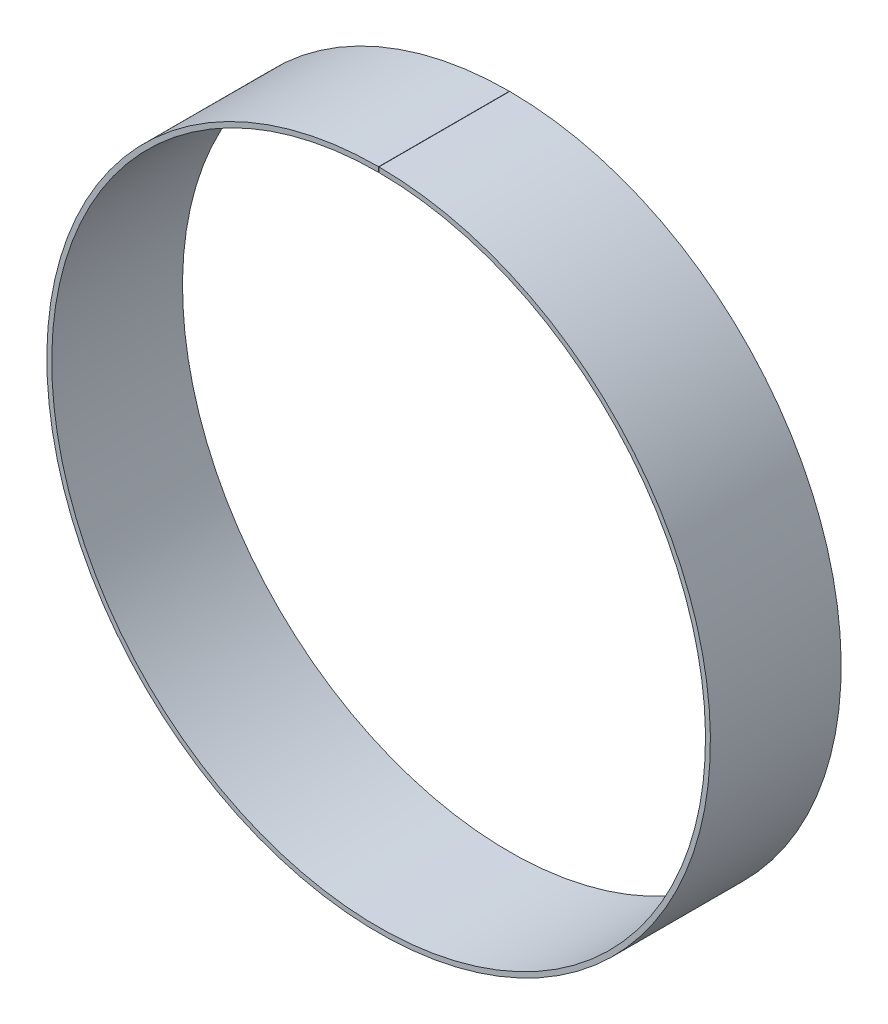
ISO-10303-21;
HEADER;
FILE_DESCRIPTION(('STEP AP214'),'2;1');
FILE_NAME('part.step','',(''),(''),'','','');
FILE_SCHEMA(('AUTOMOTIVE_DESIGN { 1 0 10303 214 1 1 1 1 }'));
ENDSEC;
DATA;
#1=APPLICATION_CONTEXT('core data for automotive mechanical design processes');
#2=APPLICATION_PROTOCOL_DEFINITION('international standard','automotive_design',2000,#1);
#3=PRODUCT_CONTEXT('',#1,'mechanical');
#4=PRODUCT('Part','Part','',(#3));
#5=PRODUCT_RELATED_PRODUCT_CATEGORY('part','',(#4));
#6=PRODUCT_DEFINITION_FORMATION('','',#4);
#7=PRODUCT_DEFINITION_CONTEXT('part definition',#1,'design');
#8=PRODUCT_DEFINITION('design','',#6,#7);
#9=PRODUCT_DEFINITION_SHAPE('','',#8);
#10=(LENGTH_UNIT() NAMED_UNIT(*) SI_UNIT(.MILLI.,.METRE.));
#11=(NAMED_UNIT(*) PLANE_ANGLE_UNIT() SI_UNIT($,.RADIAN.));
#12=(NAMED_UNIT(*) SI_UNIT($,.STERADIAN.) SOLID_ANGLE_UNIT());
#13=UNCERTAINTY_MEASURE_WITH_UNIT(LENGTH_MEASURE(1.E-05),#10,'distance_accuracy_value','');
#14=(GEOMETRIC_REPRESENTATION_CONTEXT(3) GLOBAL_UNCERTAINTY_ASSIGNED_CONTEXT((#13)) GLOBAL_UNIT_ASSIGNED_CONTEXT((#10,
#11,#12)) REPRESENTATION_CONTEXT('',''));
#15=CARTESIAN_POINT('',(0.,0.,0.));
#16=DIRECTION('',(0.,0.,1.));
#17=DIRECTION('',(1.,0.,0.));
#18=AXIS2_PLACEMENT_3D('',#15,#16,#17);
#19=CARTESIAN_POINT('',(0.,0.,20.));
#20=DIRECTION('',(0.,0.,-1.));
#21=DIRECTION('',(-1.,0.,0.));
#22=AXIS2_PLACEMENT_3D('',#19,#20,#21);
#23=CYLINDRICAL_SURFACE('',#22,101.5);
#24=CARTESIAN_POINT('',(0.,0.,-20.));
#25=DIRECTION('',(0.,0.,1.));
#26=DIRECTION('',(1.,0.,0.));
#27=AXIS2_PLACEMENT_3D('',#24,#25,#26);
#28=CIRCLE('',#27,101.5);
#29=CARTESIAN_POINT('',(0.,101.5,-20.));
#30=VERTEX_POINT('',#29);
#31=CARTESIAN_POINT('',(0.101499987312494,101.49994925,-20.));
#32=VERTEX_POINT('',#31);
#33=EDGE_CURVE('E97',#30,#32,#28,.T.);
#34=ORIENTED_EDGE('',*,*,#33,.T.);
#35=DIRECTION('',(0.,0.,-1.));
#36=VECTOR('',#35,1.);
#37=CARTESIAN_POINT('',(0.101499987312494,101.49994925,20.));
#38=LINE('',#37,#36);
#39=CARTESIAN_POINT('',(0.101499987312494,101.49994925,20.));
#40=VERTEX_POINT('',#39);
#41=EDGE_CURVE('E11',#40,#32,#38,.T.);
#42=ORIENTED_EDGE('',*,*,#41,.F.);
#43=CARTESIAN_POINT('',(0.,0.,20.));
#44=DIRECTION('',(0.,0.,1.));
#45=DIRECTION('',(1.,0.,0.));
#46=AXIS2_PLACEMENT_3D('',#43,#44,#45);
#47=CIRCLE('',#46,101.5);
#48=CARTESIAN_POINT('',(0.,101.5,20.));
#49=VERTEX_POINT('',#48);
#50=EDGE_CURVE('E74',#49,#40,#47,.T.);
#51=ORIENTED_EDGE('',*,*,#50,.F.);
#52=DIRECTION('',(0.,0.,-1.));
#53=VECTOR('',#52,1.);
#54=CARTESIAN_POINT('',(0.,101.5,20.));
#55=LINE('',#54,#53);
#56=EDGE_CURVE('E50',#49,#30,#55,.T.);
#57=ORIENTED_EDGE('',*,*,#56,.T.);
#58=EDGE_LOOP('',(#34,#42,#51,#57));
#59=FACE_BOUND('',#58,.T.);
#60=ADVANCED_FACE('F34',(#59),#23,.T.);
#61=CARTESIAN_POINT('',(0.0999999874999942,99.99995,20.));
#62=DIRECTION('',(-0.9999995,0.000999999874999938,0.));
#63=DIRECTION('',(-0.000999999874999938,-0.9999995,0.));
#64=AXIS2_PLACEMENT_3D('',#61,#62,#63);
#65=PLANE('',#64);
#66=DIRECTION('',(0.000999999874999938,0.9999995,0.));
#67=VECTOR('',#66,1.);
#68=CARTESIAN_POINT('',(0.0999999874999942,99.99995,-20.));
#69=LINE('',#68,#67);
#70=CARTESIAN_POINT('',(0.0999999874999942,99.99995,-20.));
#71=VERTEX_POINT('',#70);
#72=EDGE_CURVE('E83',#71,#32,#69,.T.);
#73=ORIENTED_EDGE('',*,*,#72,.F.);
#74=DIRECTION('',(0.,0.,-1.));
#75=VECTOR('',#74,1.);
#76=CARTESIAN_POINT('',(0.0999999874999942,99.99995,20.));
#77=LINE('',#76,#75);
#78=CARTESIAN_POINT('',(0.0999999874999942,99.99995,20.));
#79=VERTEX_POINT('',#78);
#80=EDGE_CURVE('E42',#79,#71,#77,.T.);
#81=ORIENTED_EDGE('',*,*,#80,.F.);
#82=DIRECTION('',(0.000999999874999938,0.9999995,0.));
#83=VECTOR('',#82,1.);
#84=CARTESIAN_POINT('',(0.0999999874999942,99.99995,20.));
#85=LINE('',#84,#83);
#86=EDGE_CURVE('E81',#79,#40,#85,.T.);
#87=ORIENTED_EDGE('',*,*,#86,.T.);
#88=ORIENTED_EDGE('',*,*,#41,.T.);
#89=EDGE_LOOP('',(#73,#81,#87,#88));
#90=FACE_BOUND('',#89,.T.);
#91=ADVANCED_FACE('F80',(#90),#65,.T.);
#92=CARTESIAN_POINT('',(0.,0.,20.));
#93=DIRECTION('',(0.,0.,-1.));
#94=DIRECTION('',(-1.,0.,0.));
#95=AXIS2_PLACEMENT_3D('',#92,#93,#94);
#96=CYLINDRICAL_SURFACE('',#95,100.);
#97=CARTESIAN_POINT('',(0.,0.,-20.));
#98=DIRECTION('',(0.,0.,1.));
#99=DIRECTION('',(1.,0.,0.));
#100=AXIS2_PLACEMENT_3D('',#97,#98,#99);
#101=CIRCLE('',#100,100.);
#102=CARTESIAN_POINT('',(0.,100.,-20.));
#103=VERTEX_POINT('',#102);
#104=EDGE_CURVE('E100',#103,#71,#101,.T.);
#105=ORIENTED_EDGE('',*,*,#104,.F.);
#106=DIRECTION('',(0.,0.,-1.));
#107=VECTOR('',#106,1.);
#108=CARTESIAN_POINT('',(0.,100.,20.));
#109=LINE('',#108,#107);
#110=CARTESIAN_POINT('',(0.,100.,20.));
#111=VERTEX_POINT('',#110);
#112=EDGE_CURVE('E63',#111,#103,#109,.T.);
#113=ORIENTED_EDGE('',*,*,#112,.F.);
#114=CARTESIAN_POINT('',(0.,0.,20.));
#115=DIRECTION('',(0.,0.,1.));
#116=DIRECTION('',(1.,0.,0.));
#117=AXIS2_PLACEMENT_3D('',#114,#115,#116);
#118=CIRCLE('',#117,100.);
#119=EDGE_CURVE('E89',#111,#79,#118,.T.);
#120=ORIENTED_EDGE('',*,*,#119,.T.);
#121=ORIENTED_EDGE('',*,*,#80,.T.);
#122=EDGE_LOOP('',(#105,#113,#120,#121));
#123=FACE_BOUND('',#122,.T.);
#124=ADVANCED_FACE('F91',(#123),#96,.F.);
#125=CARTESIAN_POINT('',(0.,101.5,20.));
#126=DIRECTION('',(1.,0.,0.));
#127=DIRECTION('',(0.,1.,0.));
#128=AXIS2_PLACEMENT_3D('',#125,#126,#127);
#129=PLANE('',#128);
#130=DIRECTION('',(0.,-1.,0.));
#131=VECTOR('',#130,1.);
#132=CARTESIAN_POINT('',(0.,101.5,-20.));
#133=LINE('',#132,#131);
#134=EDGE_CURVE('E102',#30,#103,#133,.T.);
#135=ORIENTED_EDGE('',*,*,#134,.F.);
#136=ORIENTED_EDGE('',*,*,#56,.F.);
#137=DIRECTION('',(0.,-1.,0.));
#138=VECTOR('',#137,1.);
#139=CARTESIAN_POINT('',(0.,101.5,20.));
#140=LINE('',#139,#138);
#141=EDGE_CURVE('E92',#49,#111,#140,.T.);
#142=ORIENTED_EDGE('',*,*,#141,.T.);
#143=ORIENTED_EDGE('',*,*,#112,.T.);
#144=EDGE_LOOP('',(#135,#136,#142,#143));
#145=FACE_BOUND('',#144,.T.);
#146=ADVANCED_FACE('F108',(#145),#129,.T.);
#147=CARTESIAN_POINT('',(0.,0.,20.));
#148=DIRECTION('',(0.,0.,1.));
#149=DIRECTION('',(1.,0.,0.));
#150=AXIS2_PLACEMENT_3D('',#147,#148,#149);
#151=PLANE('',#150);
#152=ORIENTED_EDGE('',*,*,#50,.T.);
#153=ORIENTED_EDGE('',*,*,#86,.F.);
#154=ORIENTED_EDGE('',*,*,#119,.F.);
#155=ORIENTED_EDGE('',*,*,#141,.F.);
#156=EDGE_LOOP('',(#152,#153,#154,#155));
#157=FACE_BOUND('',#156,.T.);
#158=ADVANCED_FACE('F88',(#157),#151,.T.);
#159=CARTESIAN_POINT('',(0.,0.,-20.));
#160=DIRECTION('',(0.,0.,1.));
#161=DIRECTION('',(1.,0.,0.));
#162=AXIS2_PLACEMENT_3D('',#159,#160,#161);
#163=PLANE('',#162);
#164=ORIENTED_EDGE('',*,*,#33,.F.);
#165=ORIENTED_EDGE('',*,*,#134,.T.);
#166=ORIENTED_EDGE('',*,*,#104,.T.);
#167=ORIENTED_EDGE('',*,*,#72,.T.);
#168=EDGE_LOOP('',(#164,#165,#166,#167));
#169=FACE_BOUND('',#168,.T.);
#170=ADVANCED_FACE('F107',(#169),#163,.F.);
#171=CLOSED_SHELL('',(#60,#91,#124,#146,#158,#170));
#172=MANIFOLD_SOLID_BREP('B2',#171);
#173=ADVANCED_BREP_SHAPE_REPRESENTATION('',(#18,#172),#14);
#174=SHAPE_DEFINITION_REPRESENTATION(#9,#173);
ENDSEC;
END-ISO-10303-21;
